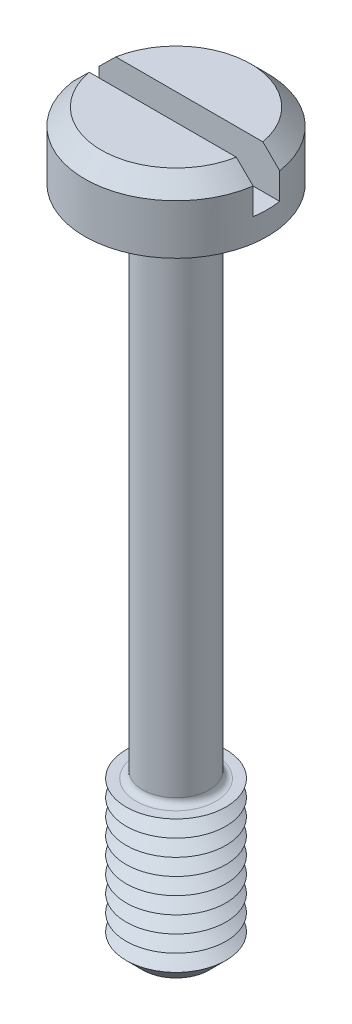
from build123d import *

# Parameters (mm, degrees)
SKETCH1_R           = 2.75
BOSS_EXTRUDE1_DEPTH = 2
SKETCH2_R           = 1
BOSS_EXTRUDE2_DEPTH = 20
SKETCH3_R           = 1.5
BOSS_EXTRUDE3_DEPTH = 4.5
CHAMFER1_SIZE       = 0.5
LPATTERN1_COUNT     = 8
LPATTERN1_PITCH     = 0.5
FILLET1_R           = 0.2
CHAMFER2_SIZE       = 0.5
SKETCH6_W           = 5.5
SKETCH6_H           = 0.8
CUT_EXTRUDE1_DEPTH  = 1.3


with BuildPart() as part:
    # Sketch1 → Boss-Extrude1 (new body)
    with BuildSketch(Plane(origin=(0, 0, 0), x_dir=(1, 0, 0), z_dir=(0, 1, 0))):
        with Locations(Location((0, 0, 0), (0, 0, 270))):
            Circle(SKETCH1_R)
    extrude(amount=BOSS_EXTRUDE1_DEPTH)

    # Sketch2 → Boss-Extrude2 (add)
    with BuildSketch(Plane.XZ):
        with Locations(Location((0, 0, 0), (0, 0, 270))):
            Circle(SKETCH2_R)
    extrude(amount=BOSS_EXTRUDE2_DEPTH)

    # Sketch3 → Boss-Extrude3 (add)
    with BuildSketch(Plane.XZ.offset(20)):
        with Locations(Location((0, 0, 0), (0, 0, 270))):
            Circle(SKETCH3_R)
    extrude(amount=-BOSS_EXTRUDE3_DEPTH)

    # Chamfer1
    chamfer1_edges = [part.edges().sort_by_distance(p)[0] for p in [
        (0, -20, 1.5),
    ]]
    chamfer(chamfer1_edges, length=CHAMFER1_SIZE)

    # Sketch5 → Cut-Revolve1 (revolve, cut)
    with BuildSketch(Plane(origin=(0, 0, 0), x_dir=(0, 0, -1), z_dir=(1, 0, 0))):
        Polygon((-1.5, -15.5), (-1.066987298, -15.75), (-1.5, -16), align=None)
    cut_revolve1 = revolve(axis=Axis((0, -6.58711856, 0), (0, -1, 0)), mode=Mode.SUBTRACT)

    # LPattern1: Cut-Revolve1 ×8
    with Locations(*[(0, -i * LPATTERN1_PITCH, 0) for i in range(1, LPATTERN1_COUNT)]):
        add(cut_revolve1, mode=Mode.SUBTRACT)

    # Fillet1
    fillet1_edges = [part.edges().sort_by_distance(p)[0] for p in [
        (0, 0, 1),
        (0, -15.5, 1),
    ]]
    fillet(fillet1_edges, radius=FILLET1_R)

    # Chamfer2
    chamfer2_edges = [part.edges().sort_by_distance(p)[0] for p in [
        (0, 2, -2.75),
    ]]
    chamfer(chamfer2_edges, length=CHAMFER2_SIZE)

    # Sketch6 → Cut-Extrude1 (cut)
    with BuildSketch(Plane(origin=(0, 2, 0), x_dir=(1, 0, 0), z_dir=(0, 1, 0))):
        Rectangle(SKETCH6_W, SKETCH6_H)
    extrude(amount=-CUT_EXTRUDE1_DEPTH, mode=Mode.SUBTRACT)


solid = part.part
